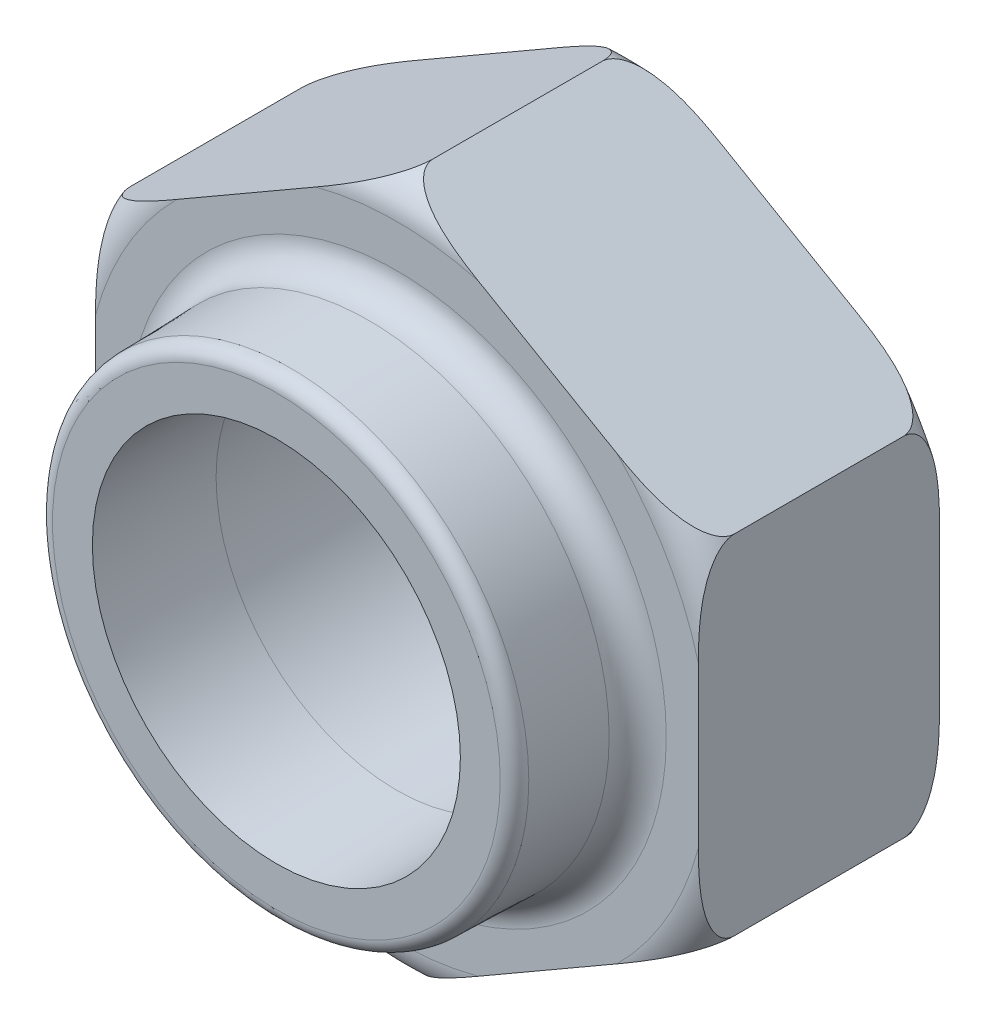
from build123d import *

# Parameters (mm, degrees)
TETE_DEPTH                 = 4
ESQUISSE3_R                = 3
ENL_V_DE_MAT_EXTRU_1_DEPTH = 9.621678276
ESQUISSE4_R                = 4
ESQUISSE4_R_2              = 3
BOSS_EXTRU_1_DEPTH         = 2
BOSS_EXTRU_1_DRAFT         = 1.499999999
CONG_1_R                   = 0.48
CONG_3_R                   = 0.24


with BuildPart() as part:
    # Esquisse1 → Tete (new body)
    with BuildSketch(Plane.XY):
        Polygon((-5, 2.886751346), (-5, -2.886751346), (0, -5.773502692), (5, -2.886751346), (5, 2.886751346), (0, 5.773502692), align=None)
    extrude(amount=TETE_DEPTH)

    # Esquisse2 → Rayon de tete (revolve, cut)
    with BuildSketch(Plane(origin=(0, 0, 0), x_dir=(0, 0, -1), z_dir=(1, 0, 0))):
        with BuildLine():
            Line((-0.6, -5.773502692), (-0.6, -15.773502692))
            Line((-0.6, -15.773502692), (8.771054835, -15.773502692))
            Line((8.771054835, -15.773502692), (8.771054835, -5.173502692))
            Line((8.771054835, -5.173502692), (0, -5.173502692))
            ThreePointArc((0, -5.173502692), (-0.175735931, -5.597766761), (-0.6, -5.773502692))
        make_face()
    rayon_de_tete = revolve(axis=Axis((0, 0, 0), (0, 0, 1)), mode=Mode.SUBTRACT)

    # Sym_trie1: Rayon de tete across plane
    add(rayon_de_tete.mirror(Plane.XY.offset(2)), mode=Mode.SUBTRACT)

    # Esquisse3 → Enl_v. de mat.-Extru.1 (cut, through all)
    with BuildSketch(Plane(origin=(0, 0, 0), x_dir=(-1, 0, 0), z_dir=(0, 0, -1))):
        Circle(ESQUISSE3_R)
    extrude(amount=-ENL_V_DE_MAT_EXTRU_1_DEPTH, mode=Mode.SUBTRACT)


with BuildPart() as boss_extru_1_tool:
    # Esquisse4 → Boss.-Extru.1 (with draft: the straight prism first)
    with BuildSketch(Plane.XY.offset(4)):
        Circle(ESQUISSE4_R)
        with Locations(Location((0, 0, 0), (0, 0, 180))):
            Circle(ESQUISSE4_R_2, mode=Mode.SUBTRACT)
    extrude(amount=BOSS_EXTRU_1_DEPTH)
    # Boss.-Extru.1: the draft: its side faces are tilted about the plane it starts from
    boss_extru_1_sides = [boss_extru_1_tool.faces().sort_by_distance(p)[0] for p in [
        (-4, 0, 5),
        (3, 0, 5),
    ]]
    draft(boss_extru_1_sides, Plane.XY.offset(4), BOSS_EXTRU_1_DRAFT)


with BuildPart() as part_1:
    add(part.part)

    # Boss.-Extru.1: add boss_extru_1_tool
    add(boss_extru_1_tool.part)

    # Cong_1
    cong_1_edges = [part_1.edges().sort_by_distance(p)[0] for p in [
        (-4, 0, 4),
    ]]
    fillet(cong_1_edges, radius=CONG_1_R)

    # Cong_3
    cong_3_edges = [part_1.edges().sort_by_distance(p)[0] for p in [
        (-3.947628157, 0, 6),
    ]]
    fillet(cong_3_edges, radius=CONG_3_R)


solid = part_1.part
